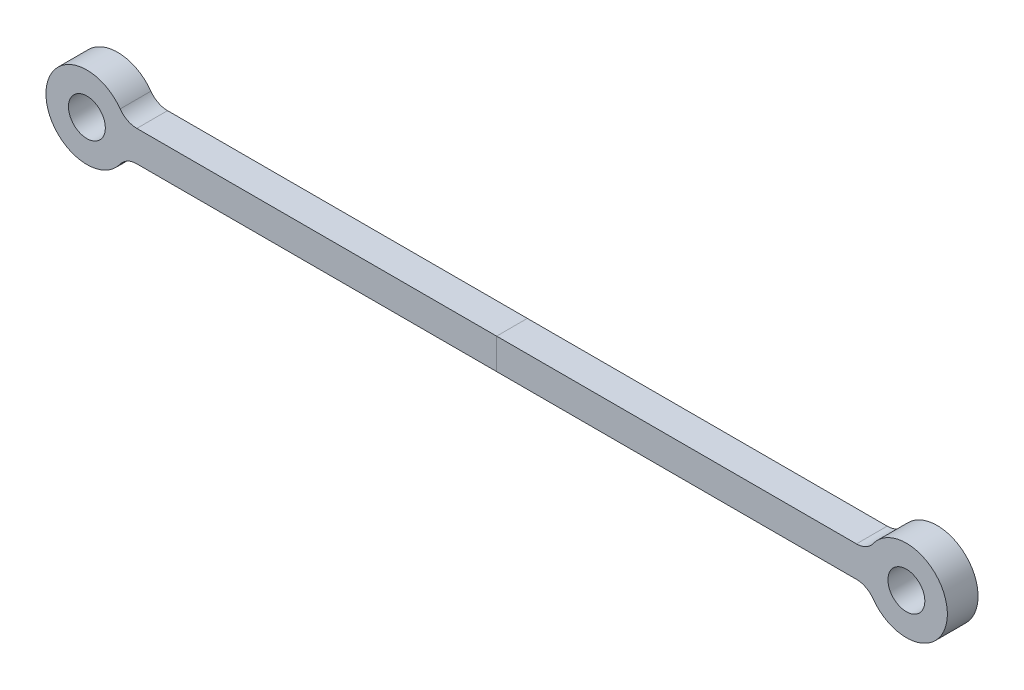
ISO-10303-21;
HEADER;
FILE_DESCRIPTION(('STEP AP214'),'2;1');
FILE_NAME('part.step','',(''),(''),'','','');
FILE_SCHEMA(('AUTOMOTIVE_DESIGN { 1 0 10303 214 1 1 1 1 }'));
ENDSEC;
DATA;
#1=APPLICATION_CONTEXT('core data for automotive mechanical design processes');
#2=APPLICATION_PROTOCOL_DEFINITION('international standard','automotive_design',2000,#1);
#3=PRODUCT_CONTEXT('',#1,'mechanical');
#4=PRODUCT('Part','Part','',(#3));
#5=PRODUCT_RELATED_PRODUCT_CATEGORY('part','',(#4));
#6=PRODUCT_DEFINITION_FORMATION('','',#4);
#7=PRODUCT_DEFINITION_CONTEXT('part definition',#1,'design');
#8=PRODUCT_DEFINITION('design','',#6,#7);
#9=PRODUCT_DEFINITION_SHAPE('','',#8);
#10=(LENGTH_UNIT() NAMED_UNIT(*) SI_UNIT(.MILLI.,.METRE.));
#11=(NAMED_UNIT(*) PLANE_ANGLE_UNIT() SI_UNIT($,.RADIAN.));
#12=(NAMED_UNIT(*) SI_UNIT($,.STERADIAN.) SOLID_ANGLE_UNIT());
#13=UNCERTAINTY_MEASURE_WITH_UNIT(LENGTH_MEASURE(1.E-05),#10,'distance_accuracy_value','');
#14=(GEOMETRIC_REPRESENTATION_CONTEXT(3) GLOBAL_UNCERTAINTY_ASSIGNED_CONTEXT((#13)) GLOBAL_UNIT_ASSIGNED_CONTEXT((#10,
#11,#12)) REPRESENTATION_CONTEXT('',''));
#15=CARTESIAN_POINT('',(0.,0.,0.));
#16=DIRECTION('',(0.,0.,1.));
#17=DIRECTION('',(1.,0.,0.));
#18=AXIS2_PLACEMENT_3D('',#15,#16,#17);
#19=CARTESIAN_POINT('',(-400.,-15.,30.));
#20=DIRECTION('',(0.,1.,0.));
#21=DIRECTION('',(0.,0.,1.));
#22=AXIS2_PLACEMENT_3D('',#19,#20,#21);
#23=PLANE('',#22);
#24=DIRECTION('',(0.,0.,-1.));
#25=VECTOR('',#24,1.);
#26=CARTESIAN_POINT('',(0.,-15.,30.));
#27=LINE('',#26,#25);
#28=CARTESIAN_POINT('',(0.,-15.,30.));
#29=VERTEX_POINT('',#28);
#30=CARTESIAN_POINT('',(0.,-15.,0.));
#31=VERTEX_POINT('',#30);
#32=EDGE_CURVE('E11',#29,#31,#27,.T.);
#33=ORIENTED_EDGE('',*,*,#32,.F.);
#34=DIRECTION('',(1.,0.,0.));
#35=VECTOR('',#34,1.);
#36=CARTESIAN_POINT('',(-400.,-15.,30.));
#37=LINE('',#36,#35);
#38=CARTESIAN_POINT('',(-351.266028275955,-15.,30.));
#39=VERTEX_POINT('',#38);
#40=EDGE_CURVE('E117',#39,#29,#37,.T.);
#41=ORIENTED_EDGE('',*,*,#40,.F.);
#42=DIRECTION('',(0.,0.,1.));
#43=VECTOR('',#42,1.);
#44=CARTESIAN_POINT('',(-351.266028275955,-15.,30.));
#45=LINE('',#44,#43);
#46=CARTESIAN_POINT('',(-351.266028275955,-15.,0.));
#47=VERTEX_POINT('',#46);
#48=EDGE_CURVE('E127',#39,#47,#45,.F.);
#49=ORIENTED_EDGE('',*,*,#48,.T.);
#50=DIRECTION('',(1.,0.,0.));
#51=VECTOR('',#50,1.);
#52=CARTESIAN_POINT('',(-400.,-15.,0.));
#53=LINE('',#52,#51);
#54=EDGE_CURVE('E227',#47,#31,#53,.T.);
#55=ORIENTED_EDGE('',*,*,#54,.T.);
#56=EDGE_LOOP('',(#33,#41,#49,#55));
#57=FACE_BOUND('',#56,.T.);
#58=ADVANCED_FACE('F36',(#57),#23,.F.);
#59=CARTESIAN_POINT('',(-400.,0.,0.));
#60=DIRECTION('',(0.,0.,1.));
#61=DIRECTION('',(1.,0.,0.));
#62=AXIS2_PLACEMENT_3D('',#59,#60,#61);
#63=PLANE('',#62);
#64=CARTESIAN_POINT('',(-400.,0.,0.));
#65=DIRECTION('',(0.,0.,1.));
#66=DIRECTION('',(1.,0.,0.));
#67=AXIS2_PLACEMENT_3D('',#64,#65,#66);
#68=CIRCLE('',#67,18.);
#69=CARTESIAN_POINT('',(-382.,0.,0.));
#70=VERTEX_POINT('',#69);
#71=EDGE_CURVE('E214',#70,#70,#68,.T.);
#72=ORIENTED_EDGE('',*,*,#71,.T.);
#73=EDGE_LOOP('',(#72));
#74=FACE_BOUND('',#73,.T.);
#75=DIRECTION('',(0.,1.,0.));
#76=VECTOR('',#75,1.);
#77=CARTESIAN_POINT('',(0.,0.,0.));
#78=LINE('',#77,#76);
#79=CARTESIAN_POINT('',(0.,15.,0.));
#80=VERTEX_POINT('',#79);
#81=EDGE_CURVE('E46',#31,#80,#78,.T.);
#82=ORIENTED_EDGE('',*,*,#81,.F.);
#83=ORIENTED_EDGE('',*,*,#54,.F.);
#84=CARTESIAN_POINT('',(-351.266028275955,-35.,0.));
#85=DIRECTION('',(0.,0.,1.));
#86=DIRECTION('',(1.,0.,0.));
#87=AXIS2_PLACEMENT_3D('',#84,#85,#86);
#88=CIRCLE('',#87,20.);
#89=CARTESIAN_POINT('',(-367.510685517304,-23.3333333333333,0.));
#90=VERTEX_POINT('',#89);
#91=EDGE_CURVE('E124',#47,#90,#88,.T.);
#92=ORIENTED_EDGE('',*,*,#91,.T.);
#93=CARTESIAN_POINT('',(-400.,0.,0.));
#94=DIRECTION('',(0.,0.,1.));
#95=DIRECTION('',(1.,0.,0.));
#96=AXIS2_PLACEMENT_3D('',#93,#94,#95);
#97=CIRCLE('',#96,40.);
#98=CARTESIAN_POINT('',(-367.510685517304,23.3333333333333,0.));
#99=VERTEX_POINT('',#98);
#100=EDGE_CURVE('E223',#90,#99,#97,.F.);
#101=ORIENTED_EDGE('',*,*,#100,.T.);
#102=CARTESIAN_POINT('',(-351.266028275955,35.,0.));
#103=DIRECTION('',(0.,0.,1.));
#104=DIRECTION('',(1.,0.,0.));
#105=AXIS2_PLACEMENT_3D('',#102,#103,#104);
#106=CIRCLE('',#105,20.);
#107=CARTESIAN_POINT('',(-351.266028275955,15.,0.));
#108=VERTEX_POINT('',#107);
#109=EDGE_CURVE('E147',#99,#108,#106,.T.);
#110=ORIENTED_EDGE('',*,*,#109,.T.);
#111=DIRECTION('',(-1.,0.,0.));
#112=VECTOR('',#111,1.);
#113=CARTESIAN_POINT('',(-400.,15.,0.));
#114=LINE('',#113,#112);
#115=EDGE_CURVE('E229',#80,#108,#114,.T.);
#116=ORIENTED_EDGE('',*,*,#115,.F.);
#117=EDGE_LOOP('',(#82,#83,#92,#101,#110,#116));
#118=FACE_BOUND('',#117,.T.);
#119=ADVANCED_FACE('F232',(#74,#118),#63,.F.);
#120=CARTESIAN_POINT('',(-400.,0.,30.));
#121=DIRECTION('',(0.,0.,1.));
#122=DIRECTION('',(1.,0.,0.));
#123=AXIS2_PLACEMENT_3D('',#120,#121,#122);
#124=PLANE('',#123);
#125=CARTESIAN_POINT('',(-400.,0.,30.));
#126=DIRECTION('',(0.,0.,1.));
#127=DIRECTION('',(1.,0.,0.));
#128=AXIS2_PLACEMENT_3D('',#125,#126,#127);
#129=CIRCLE('',#128,18.);
#130=CARTESIAN_POINT('',(-382.,0.,30.));
#131=VERTEX_POINT('',#130);
#132=EDGE_CURVE('E211',#131,#131,#129,.T.);
#133=ORIENTED_EDGE('',*,*,#132,.F.);
#134=EDGE_LOOP('',(#133));
#135=FACE_BOUND('',#134,.T.);
#136=ORIENTED_EDGE('',*,*,#40,.T.);
#137=DIRECTION('',(0.,1.,0.));
#138=VECTOR('',#137,1.);
#139=CARTESIAN_POINT('',(0.,0.,30.));
#140=LINE('',#139,#138);
#141=CARTESIAN_POINT('',(0.,15.,30.));
#142=VERTEX_POINT('',#141);
#143=EDGE_CURVE('E40',#29,#142,#140,.T.);
#144=ORIENTED_EDGE('',*,*,#143,.T.);
#145=DIRECTION('',(-1.,0.,0.));
#146=VECTOR('',#145,1.);
#147=CARTESIAN_POINT('',(-400.,15.,30.));
#148=LINE('',#147,#146);
#149=CARTESIAN_POINT('',(-351.266028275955,15.,30.));
#150=VERTEX_POINT('',#149);
#151=EDGE_CURVE('E129',#142,#150,#148,.T.);
#152=ORIENTED_EDGE('',*,*,#151,.T.);
#153=CARTESIAN_POINT('',(-351.266028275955,35.,30.));
#154=DIRECTION('',(0.,0.,1.));
#155=DIRECTION('',(1.,0.,0.));
#156=AXIS2_PLACEMENT_3D('',#153,#154,#155);
#157=CIRCLE('',#156,20.);
#158=CARTESIAN_POINT('',(-367.510685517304,23.3333333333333,30.));
#159=VERTEX_POINT('',#158);
#160=EDGE_CURVE('E123',#150,#159,#157,.F.);
#161=ORIENTED_EDGE('',*,*,#160,.T.);
#162=CARTESIAN_POINT('',(-400.,0.,30.));
#163=DIRECTION('',(0.,0.,1.));
#164=DIRECTION('',(1.,0.,0.));
#165=AXIS2_PLACEMENT_3D('',#162,#163,#164);
#166=CIRCLE('',#165,40.);
#167=CARTESIAN_POINT('',(-367.510685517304,-23.3333333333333,30.));
#168=VERTEX_POINT('',#167);
#169=EDGE_CURVE('E119',#159,#168,#166,.T.);
#170=ORIENTED_EDGE('',*,*,#169,.T.);
#171=CARTESIAN_POINT('',(-351.266028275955,-35.,30.));
#172=DIRECTION('',(0.,0.,1.));
#173=DIRECTION('',(1.,0.,0.));
#174=AXIS2_PLACEMENT_3D('',#171,#172,#173);
#175=CIRCLE('',#174,20.);
#176=EDGE_CURVE('E115',#168,#39,#175,.F.);
#177=ORIENTED_EDGE('',*,*,#176,.T.);
#178=EDGE_LOOP('',(#136,#144,#152,#161,#170,#177));
#179=FACE_BOUND('',#178,.T.);
#180=ADVANCED_FACE('F116',(#135,#179),#124,.T.);
#181=CARTESIAN_POINT('',(-400.,15.,30.));
#182=DIRECTION('',(0.,-1.,0.));
#183=DIRECTION('',(0.,0.,-1.));
#184=AXIS2_PLACEMENT_3D('',#181,#182,#183);
#185=PLANE('',#184);
#186=DIRECTION('',(0.,0.,1.));
#187=VECTOR('',#186,1.);
#188=CARTESIAN_POINT('',(0.,15.,30.));
#189=LINE('',#188,#187);
#190=EDGE_CURVE('E170',#80,#142,#189,.T.);
#191=ORIENTED_EDGE('',*,*,#190,.F.);
#192=ORIENTED_EDGE('',*,*,#115,.T.);
#193=DIRECTION('',(0.,0.,1.));
#194=VECTOR('',#193,1.);
#195=CARTESIAN_POINT('',(-351.266028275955,15.,30.));
#196=LINE('',#195,#194);
#197=EDGE_CURVE('E142',#108,#150,#196,.T.);
#198=ORIENTED_EDGE('',*,*,#197,.T.);
#199=ORIENTED_EDGE('',*,*,#151,.F.);
#200=EDGE_LOOP('',(#191,#192,#198,#199));
#201=FACE_BOUND('',#200,.T.);
#202=ADVANCED_FACE('F194',(#201),#185,.F.);
#203=ORIENTED_EDGE('',*,*,#143,.F.);
#204=CARTESIAN_POINT('',(351.266028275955,-15.,30.));
#205=VERTEX_POINT('',#204);
#206=EDGE_CURVE('E130',#29,#205,#37,.T.);
#207=ORIENTED_EDGE('',*,*,#206,.T.);
#208=CARTESIAN_POINT('',(351.266028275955,-35.,30.));
#209=DIRECTION('',(0.,0.,1.));
#210=DIRECTION('',(1.,0.,0.));
#211=AXIS2_PLACEMENT_3D('',#208,#209,#210);
#212=CIRCLE('',#211,20.);
#213=CARTESIAN_POINT('',(367.510685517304,-23.3333333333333,30.));
#214=VERTEX_POINT('',#213);
#215=EDGE_CURVE('E164',#205,#214,#212,.F.);
#216=ORIENTED_EDGE('',*,*,#215,.T.);
#217=CARTESIAN_POINT('',(400.,0.,30.));
#218=DIRECTION('',(0.,0.,-1.));
#219=DIRECTION('',(-1.,0.,0.));
#220=AXIS2_PLACEMENT_3D('',#217,#218,#219);
#221=CIRCLE('',#220,40.);
#222=CARTESIAN_POINT('',(367.510685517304,23.3333333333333,30.));
#223=VERTEX_POINT('',#222);
#224=EDGE_CURVE('E200',#223,#214,#221,.T.);
#225=ORIENTED_EDGE('',*,*,#224,.F.);
#226=CARTESIAN_POINT('',(351.266028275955,35.,30.));
#227=DIRECTION('',(0.,0.,1.));
#228=DIRECTION('',(1.,0.,0.));
#229=AXIS2_PLACEMENT_3D('',#226,#227,#228);
#230=CIRCLE('',#229,20.);
#231=CARTESIAN_POINT('',(351.266028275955,15.,30.));
#232=VERTEX_POINT('',#231);
#233=EDGE_CURVE('E166',#223,#232,#230,.F.);
#234=ORIENTED_EDGE('',*,*,#233,.T.);
#235=EDGE_CURVE('E134',#232,#142,#148,.T.);
#236=ORIENTED_EDGE('',*,*,#235,.T.);
#237=EDGE_LOOP('',(#203,#207,#216,#225,#234,#236));
#238=FACE_BOUND('',#237,.T.);
#239=CARTESIAN_POINT('',(400.,0.,30.));
#240=DIRECTION('',(0.,0.,-1.));
#241=DIRECTION('',(-1.,0.,0.));
#242=AXIS2_PLACEMENT_3D('',#239,#240,#241);
#243=CIRCLE('',#242,18.);
#244=CARTESIAN_POINT('',(382.,0.,30.));
#245=VERTEX_POINT('',#244);
#246=EDGE_CURVE('E267',#245,#245,#243,.T.);
#247=ORIENTED_EDGE('',*,*,#246,.T.);
#248=EDGE_LOOP('',(#247));
#249=FACE_BOUND('',#248,.T.);
#250=ADVANCED_FACE('F196',(#238,#249),#124,.T.);
#251=CARTESIAN_POINT('',(351.266028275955,-15.,0.));
#252=VERTEX_POINT('',#251);
#253=EDGE_CURVE('E226',#31,#252,#53,.T.);
#254=ORIENTED_EDGE('',*,*,#253,.F.);
#255=ORIENTED_EDGE('',*,*,#81,.T.);
#256=CARTESIAN_POINT('',(351.266028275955,15.,0.));
#257=VERTEX_POINT('',#256);
#258=EDGE_CURVE('E191',#257,#80,#114,.T.);
#259=ORIENTED_EDGE('',*,*,#258,.F.);
#260=CARTESIAN_POINT('',(351.266028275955,35.,0.));
#261=DIRECTION('',(0.,0.,1.));
#262=DIRECTION('',(1.,0.,0.));
#263=AXIS2_PLACEMENT_3D('',#260,#261,#262);
#264=CIRCLE('',#263,20.);
#265=CARTESIAN_POINT('',(367.510685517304,23.3333333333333,0.));
#266=VERTEX_POINT('',#265);
#267=EDGE_CURVE('E168',#257,#266,#264,.T.);
#268=ORIENTED_EDGE('',*,*,#267,.T.);
#269=CARTESIAN_POINT('',(400.,0.,0.));
#270=DIRECTION('',(0.,0.,1.));
#271=DIRECTION('',(1.,0.,0.));
#272=AXIS2_PLACEMENT_3D('',#269,#270,#271);
#273=CIRCLE('',#272,40.);
#274=CARTESIAN_POINT('',(367.510685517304,-23.3333333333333,0.));
#275=VERTEX_POINT('',#274);
#276=EDGE_CURVE('E210',#275,#266,#273,.T.);
#277=ORIENTED_EDGE('',*,*,#276,.F.);
#278=CARTESIAN_POINT('',(351.266028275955,-35.,0.));
#279=DIRECTION('',(0.,0.,1.));
#280=DIRECTION('',(1.,0.,0.));
#281=AXIS2_PLACEMENT_3D('',#278,#279,#280);
#282=CIRCLE('',#281,20.);
#283=EDGE_CURVE('E161',#275,#252,#282,.T.);
#284=ORIENTED_EDGE('',*,*,#283,.T.);
#285=EDGE_LOOP('',(#254,#255,#259,#268,#277,#284));
#286=FACE_BOUND('',#285,.T.);
#287=CARTESIAN_POINT('',(400.,0.,0.));
#288=DIRECTION('',(0.,0.,-1.));
#289=DIRECTION('',(-1.,0.,0.));
#290=AXIS2_PLACEMENT_3D('',#287,#288,#289);
#291=CIRCLE('',#290,18.);
#292=CARTESIAN_POINT('',(382.,0.,0.));
#293=VERTEX_POINT('',#292);
#294=EDGE_CURVE('E216',#293,#293,#291,.T.);
#295=ORIENTED_EDGE('',*,*,#294,.F.);
#296=EDGE_LOOP('',(#295));
#297=FACE_BOUND('',#296,.T.);
#298=ADVANCED_FACE('F254',(#286,#297),#63,.F.);
#299=ORIENTED_EDGE('',*,*,#206,.F.);
#300=ORIENTED_EDGE('',*,*,#32,.T.);
#301=ORIENTED_EDGE('',*,*,#253,.T.);
#302=DIRECTION('',(0.,0.,-1.));
#303=VECTOR('',#302,1.);
#304=CARTESIAN_POINT('',(351.266028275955,-15.,30.));
#305=LINE('',#304,#303);
#306=EDGE_CURVE('E156',#252,#205,#305,.F.);
#307=ORIENTED_EDGE('',*,*,#306,.T.);
#308=EDGE_LOOP('',(#299,#300,#301,#307));
#309=FACE_BOUND('',#308,.T.);
#310=ADVANCED_FACE('F38',(#309),#23,.F.);
#311=ORIENTED_EDGE('',*,*,#258,.T.);
#312=ORIENTED_EDGE('',*,*,#190,.T.);
#313=ORIENTED_EDGE('',*,*,#235,.F.);
#314=DIRECTION('',(0.,0.,-1.));
#315=VECTOR('',#314,1.);
#316=CARTESIAN_POINT('',(351.266028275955,15.,0.));
#317=LINE('',#316,#315);
#318=EDGE_CURVE('E159',#232,#257,#317,.T.);
#319=ORIENTED_EDGE('',*,*,#318,.T.);
#320=EDGE_LOOP('',(#311,#312,#313,#319));
#321=FACE_BOUND('',#320,.T.);
#322=ADVANCED_FACE('F189',(#321),#185,.F.);
#323=CARTESIAN_POINT('',(-400.,0.,-113.137084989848));
#324=DIRECTION('',(0.,0.,1.));
#325=DIRECTION('',(1.,0.,0.));
#326=AXIS2_PLACEMENT_3D('',#323,#324,#325);
#327=CYLINDRICAL_SURFACE('',#326,40.);
#328=ORIENTED_EDGE('',*,*,#100,.F.);
#329=DIRECTION('',(0.,0.,1.));
#330=VECTOR('',#329,1.);
#331=CARTESIAN_POINT('',(-367.510685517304,-23.3333333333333,-113.137084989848));
#332=LINE('',#331,#330);
#333=EDGE_CURVE('E136',#90,#168,#332,.T.);
#334=ORIENTED_EDGE('',*,*,#333,.T.);
#335=ORIENTED_EDGE('',*,*,#169,.F.);
#336=DIRECTION('',(0.,0.,1.));
#337=VECTOR('',#336,1.);
#338=CARTESIAN_POINT('',(-367.510685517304,23.3333333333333,-113.137084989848));
#339=LINE('',#338,#337);
#340=EDGE_CURVE('E133',#159,#99,#339,.F.);
#341=ORIENTED_EDGE('',*,*,#340,.T.);
#342=EDGE_LOOP('',(#328,#334,#335,#341));
#343=FACE_BOUND('',#342,.T.);
#344=ADVANCED_FACE('F238',(#343),#327,.T.);
#345=CARTESIAN_POINT('',(-400.,0.,0.));
#346=DIRECTION('',(0.,0.,1.));
#347=DIRECTION('',(1.,0.,0.));
#348=AXIS2_PLACEMENT_3D('',#345,#346,#347);
#349=CYLINDRICAL_SURFACE('',#348,18.);
#350=ORIENTED_EDGE('',*,*,#71,.F.);
#351=EDGE_LOOP('',(#350));
#352=FACE_BOUND('',#351,.T.);
#353=ORIENTED_EDGE('',*,*,#132,.T.);
#354=EDGE_LOOP('',(#353));
#355=FACE_BOUND('',#354,.T.);
#356=ADVANCED_FACE('F240',(#352,#355),#349,.F.);
#357=CARTESIAN_POINT('',(-351.266028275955,-35.,-113.137084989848));
#358=DIRECTION('',(0.,0.,1.));
#359=DIRECTION('',(1.,0.,0.));
#360=AXIS2_PLACEMENT_3D('',#357,#358,#359);
#361=CYLINDRICAL_SURFACE('',#360,20.);
#362=ORIENTED_EDGE('',*,*,#176,.F.);
#363=ORIENTED_EDGE('',*,*,#333,.F.);
#364=ORIENTED_EDGE('',*,*,#91,.F.);
#365=ORIENTED_EDGE('',*,*,#48,.F.);
#366=EDGE_LOOP('',(#362,#363,#364,#365));
#367=FACE_BOUND('',#366,.T.);
#368=ADVANCED_FACE('F132',(#367),#361,.F.);
#369=CARTESIAN_POINT('',(-351.266028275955,35.,-113.137084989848));
#370=DIRECTION('',(0.,0.,1.));
#371=DIRECTION('',(1.,0.,0.));
#372=AXIS2_PLACEMENT_3D('',#369,#370,#371);
#373=CYLINDRICAL_SURFACE('',#372,20.);
#374=ORIENTED_EDGE('',*,*,#109,.F.);
#375=ORIENTED_EDGE('',*,*,#340,.F.);
#376=ORIENTED_EDGE('',*,*,#160,.F.);
#377=ORIENTED_EDGE('',*,*,#197,.F.);
#378=EDGE_LOOP('',(#374,#375,#376,#377));
#379=FACE_BOUND('',#378,.T.);
#380=ADVANCED_FACE('F236',(#379),#373,.F.);
#381=CARTESIAN_POINT('',(400.,0.,-113.137084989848));
#382=DIRECTION('',(0.,0.,1.));
#383=DIRECTION('',(1.,0.,0.));
#384=AXIS2_PLACEMENT_3D('',#381,#382,#383);
#385=CYLINDRICAL_SURFACE('',#384,40.);
#386=ORIENTED_EDGE('',*,*,#224,.T.);
#387=DIRECTION('',(0.,0.,1.));
#388=VECTOR('',#387,1.);
#389=CARTESIAN_POINT('',(367.510685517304,-23.3333333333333,-113.137084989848));
#390=LINE('',#389,#388);
#391=EDGE_CURVE('E153',#214,#275,#390,.F.);
#392=ORIENTED_EDGE('',*,*,#391,.T.);
#393=ORIENTED_EDGE('',*,*,#276,.T.);
#394=DIRECTION('',(0.,0.,1.));
#395=VECTOR('',#394,1.);
#396=CARTESIAN_POINT('',(367.510685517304,23.3333333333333,-113.137084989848));
#397=LINE('',#396,#395);
#398=EDGE_CURVE('E150',#266,#223,#397,.T.);
#399=ORIENTED_EDGE('',*,*,#398,.T.);
#400=EDGE_LOOP('',(#386,#392,#393,#399));
#401=FACE_BOUND('',#400,.T.);
#402=ADVANCED_FACE('F207',(#401),#385,.T.);
#403=CARTESIAN_POINT('',(400.,0.,0.));
#404=DIRECTION('',(0.,0.,1.));
#405=DIRECTION('',(1.,0.,0.));
#406=AXIS2_PLACEMENT_3D('',#403,#404,#405);
#407=CYLINDRICAL_SURFACE('',#406,18.);
#408=ORIENTED_EDGE('',*,*,#294,.T.);
#409=EDGE_LOOP('',(#408));
#410=FACE_BOUND('',#409,.T.);
#411=ORIENTED_EDGE('',*,*,#246,.F.);
#412=EDGE_LOOP('',(#411));
#413=FACE_BOUND('',#412,.T.);
#414=ADVANCED_FACE('F272',(#410,#413),#407,.F.);
#415=CARTESIAN_POINT('',(351.266028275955,-35.,-113.137084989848));
#416=DIRECTION('',(0.,0.,1.));
#417=DIRECTION('',(1.,0.,0.));
#418=AXIS2_PLACEMENT_3D('',#415,#416,#417);
#419=CYLINDRICAL_SURFACE('',#418,20.);
#420=ORIENTED_EDGE('',*,*,#215,.F.);
#421=ORIENTED_EDGE('',*,*,#306,.F.);
#422=ORIENTED_EDGE('',*,*,#283,.F.);
#423=ORIENTED_EDGE('',*,*,#391,.F.);
#424=EDGE_LOOP('',(#420,#421,#422,#423));
#425=FACE_BOUND('',#424,.T.);
#426=ADVANCED_FACE('F262',(#425),#419,.F.);
#427=CARTESIAN_POINT('',(351.266028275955,35.,-113.137084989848));
#428=DIRECTION('',(0.,0.,1.));
#429=DIRECTION('',(1.,0.,0.));
#430=AXIS2_PLACEMENT_3D('',#427,#428,#429);
#431=CYLINDRICAL_SURFACE('',#430,20.);
#432=ORIENTED_EDGE('',*,*,#267,.F.);
#433=ORIENTED_EDGE('',*,*,#318,.F.);
#434=ORIENTED_EDGE('',*,*,#233,.F.);
#435=ORIENTED_EDGE('',*,*,#398,.F.);
#436=EDGE_LOOP('',(#432,#433,#434,#435));
#437=FACE_BOUND('',#436,.T.);
#438=ADVANCED_FACE('F204',(#437),#431,.F.);
#439=CLOSED_SHELL('',(#58,#119,#180,#202,#250,#298,#310,#322,#344,#356,#368,#380,#402,#414,#426,#438));
#440=MANIFOLD_SOLID_BREP('B2',#439);
#441=ADVANCED_BREP_SHAPE_REPRESENTATION('',(#18,#440),#14);
#442=SHAPE_DEFINITION_REPRESENTATION(#9,#441);
ENDSEC;
END-ISO-10303-21;
